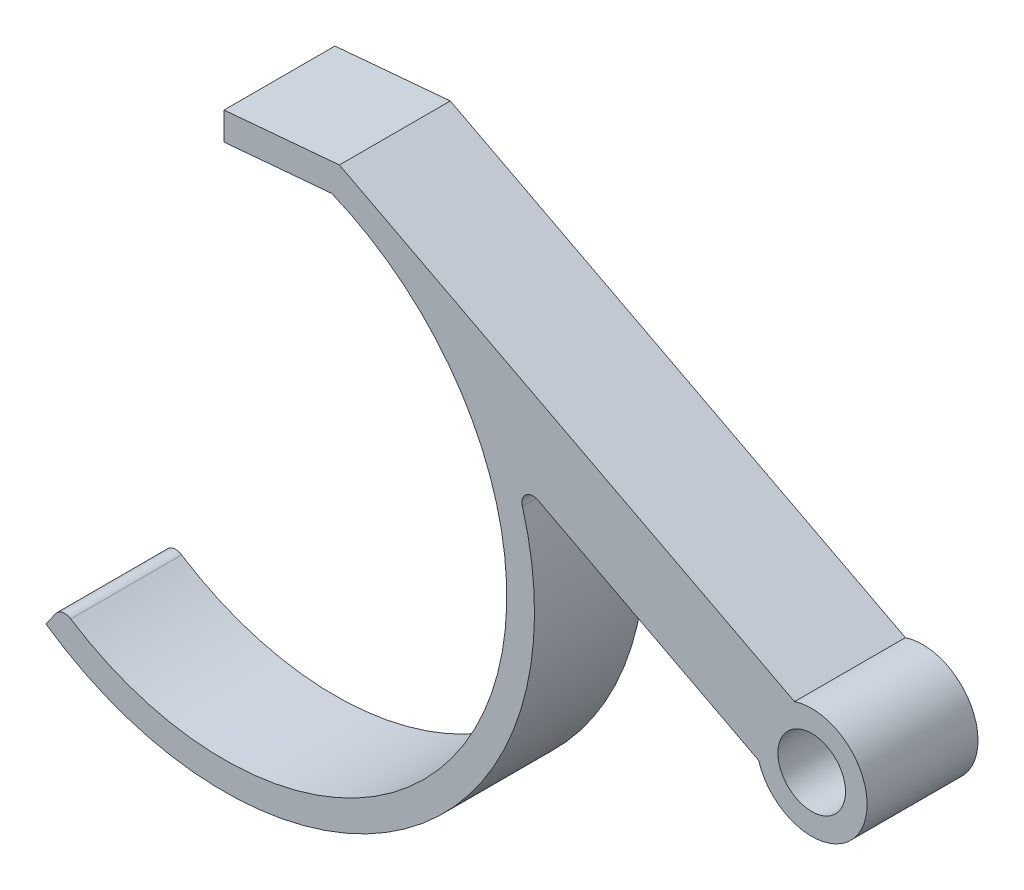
ISO-10303-21;
HEADER;
FILE_DESCRIPTION(('STEP AP214'),'2;1');
FILE_NAME('part.step','',(''),(''),'','','');
FILE_SCHEMA(('AUTOMOTIVE_DESIGN { 1 0 10303 214 1 1 1 1 }'));
ENDSEC;
DATA;
#1=APPLICATION_CONTEXT('core data for automotive mechanical design processes');
#2=APPLICATION_PROTOCOL_DEFINITION('international standard','automotive_design',2000,#1);
#3=PRODUCT_CONTEXT('',#1,'mechanical');
#4=PRODUCT('Part','Part','',(#3));
#5=PRODUCT_RELATED_PRODUCT_CATEGORY('part','',(#4));
#6=PRODUCT_DEFINITION_FORMATION('','',#4);
#7=PRODUCT_DEFINITION_CONTEXT('part definition',#1,'design');
#8=PRODUCT_DEFINITION('design','',#6,#7);
#9=PRODUCT_DEFINITION_SHAPE('','',#8);
#10=(LENGTH_UNIT() NAMED_UNIT(*) SI_UNIT(.MILLI.,.METRE.));
#11=(NAMED_UNIT(*) PLANE_ANGLE_UNIT() SI_UNIT($,.RADIAN.));
#12=(NAMED_UNIT(*) SI_UNIT($,.STERADIAN.) SOLID_ANGLE_UNIT());
#13=UNCERTAINTY_MEASURE_WITH_UNIT(LENGTH_MEASURE(1.E-05),#10,'distance_accuracy_value','');
#14=(GEOMETRIC_REPRESENTATION_CONTEXT(3) GLOBAL_UNCERTAINTY_ASSIGNED_CONTEXT((#13)) GLOBAL_UNIT_ASSIGNED_CONTEXT((#10,
#11,#12)) REPRESENTATION_CONTEXT('',''));
#15=CARTESIAN_POINT('',(0.,0.,0.));
#16=DIRECTION('',(0.,0.,1.));
#17=DIRECTION('',(1.,0.,0.));
#18=AXIS2_PLACEMENT_3D('',#15,#16,#17);
#19=CARTESIAN_POINT('',(27.8674439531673,8.02530793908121,10.));
#20=DIRECTION('',(0.,0.,-1.));
#21=DIRECTION('',(-1.,0.,0.));
#22=AXIS2_PLACEMENT_3D('',#19,#20,#21);
#23=CYLINDRICAL_SURFACE('',#22,1.);
#24=CARTESIAN_POINT('',(27.8674439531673,8.02530793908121,0.));
#25=DIRECTION('',(0.,0.,1.));
#26=DIRECTION('',(1.,0.,0.));
#27=AXIS2_PLACEMENT_3D('',#24,#25,#26);
#28=CIRCLE('',#27,1.);
#29=CARTESIAN_POINT('',(28.3296569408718,8.91207687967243,0.));
#30=VERTEX_POINT('',#29);
#31=CARTESIAN_POINT('',(26.9064976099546,7.74857318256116,0.));
#32=VERTEX_POINT('',#31);
#33=EDGE_CURVE('E147',#30,#32,#28,.T.);
#34=ORIENTED_EDGE('',*,*,#33,.F.);
#35=DIRECTION('',(0.,0.,-1.));
#36=VECTOR('',#35,1.);
#37=CARTESIAN_POINT('',(28.3296569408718,8.91207687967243,10.));
#38=LINE('',#37,#36);
#39=CARTESIAN_POINT('',(28.3296569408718,8.91207687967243,10.));
#40=VERTEX_POINT('',#39);
#41=EDGE_CURVE('E11',#40,#30,#38,.T.);
#42=ORIENTED_EDGE('',*,*,#41,.F.);
#43=CARTESIAN_POINT('',(27.8674439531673,8.02530793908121,10.));
#44=DIRECTION('',(0.,0.,1.));
#45=DIRECTION('',(1.,0.,0.));
#46=AXIS2_PLACEMENT_3D('',#43,#44,#45);
#47=CIRCLE('',#46,1.);
#48=CARTESIAN_POINT('',(26.9064976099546,7.74857318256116,10.));
#49=VERTEX_POINT('',#48);
#50=EDGE_CURVE('E177',#40,#49,#47,.T.);
#51=ORIENTED_EDGE('',*,*,#50,.T.);
#52=DIRECTION('',(0.,0.,-1.));
#53=VECTOR('',#52,1.);
#54=CARTESIAN_POINT('',(26.9064976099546,7.74857318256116,10.));
#55=LINE('',#54,#53);
#56=EDGE_CURVE('E94',#49,#32,#55,.T.);
#57=ORIENTED_EDGE('',*,*,#56,.T.);
#58=EDGE_LOOP('',(#34,#42,#51,#57));
#59=FACE_BOUND('',#58,.T.);
#60=ADVANCED_FACE('F34',(#59),#23,.F.);
#61=CARTESIAN_POINT('',(9.70521938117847,18.6197431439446,10.));
#62=DIRECTION('',(-0.462212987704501,-0.886768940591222,0.));
#63=DIRECTION('',(0.886768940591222,-0.462212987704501,0.));
#64=AXIS2_PLACEMENT_3D('',#61,#62,#63);
#65=PLANE('',#64);
#66=DIRECTION('',(-0.886768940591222,0.462212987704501,0.));
#67=VECTOR('',#66,1.);
#68=CARTESIAN_POINT('',(9.70521938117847,18.6197431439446,0.));
#69=LINE('',#68,#67);
#70=CARTESIAN_POINT('',(48.2158560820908,-1.45326080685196,0.));
#71=VERTEX_POINT('',#70);
#72=EDGE_CURVE('E150',#71,#30,#69,.T.);
#73=ORIENTED_EDGE('',*,*,#72,.F.);
#74=DIRECTION('',(0.,0.,-1.));
#75=VECTOR('',#74,1.);
#76=CARTESIAN_POINT('',(48.2158560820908,-1.45326080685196,10.));
#77=LINE('',#76,#75);
#78=CARTESIAN_POINT('',(48.2158560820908,-1.45326080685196,10.));
#79=VERTEX_POINT('',#78);
#80=EDGE_CURVE('E42',#79,#71,#77,.T.);
#81=ORIENTED_EDGE('',*,*,#80,.F.);
#82=DIRECTION('',(-0.886768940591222,0.462212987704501,0.));
#83=VECTOR('',#82,1.);
#84=CARTESIAN_POINT('',(9.70521938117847,18.6197431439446,10.));
#85=LINE('',#84,#83);
#86=EDGE_CURVE('E206',#79,#40,#85,.T.);
#87=ORIENTED_EDGE('',*,*,#86,.T.);
#88=ORIENTED_EDGE('',*,*,#41,.T.);
#89=EDGE_LOOP('',(#73,#81,#87,#88));
#90=FACE_BOUND('',#89,.T.);
#91=ADVANCED_FACE('F205',(#90),#65,.T.);
#92=CARTESIAN_POINT('',(53.,0.,10.));
#93=DIRECTION('',(0.,0.,-1.));
#94=DIRECTION('',(-1.,0.,0.));
#95=AXIS2_PLACEMENT_3D('',#92,#93,#94);
#96=CYLINDRICAL_SURFACE('',#95,5.);
#97=CARTESIAN_POINT('',(53.,0.,0.));
#98=DIRECTION('',(0.,0.,1.));
#99=DIRECTION('',(1.,0.,0.));
#100=AXIS2_PLACEMENT_3D('',#97,#98,#99);
#101=CIRCLE('',#100,5.);
#102=CARTESIAN_POINT('',(51.4513469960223,4.7541217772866,0.));
#103=VERTEX_POINT('',#102);
#104=EDGE_CURVE('E153',#71,#103,#101,.T.);
#105=ORIENTED_EDGE('',*,*,#104,.T.);
#106=DIRECTION('',(0.,0.,-1.));
#107=VECTOR('',#106,1.);
#108=CARTESIAN_POINT('',(51.4513469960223,4.7541217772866,10.));
#109=LINE('',#108,#107);
#110=CARTESIAN_POINT('',(51.4513469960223,4.7541217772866,10.));
#111=VERTEX_POINT('',#110);
#112=EDGE_CURVE('E189',#111,#103,#109,.T.);
#113=ORIENTED_EDGE('',*,*,#112,.F.);
#114=CARTESIAN_POINT('',(53.,0.,10.));
#115=DIRECTION('',(0.,0.,1.));
#116=DIRECTION('',(1.,0.,0.));
#117=AXIS2_PLACEMENT_3D('',#114,#115,#116);
#118=CIRCLE('',#117,5.);
#119=EDGE_CURVE('E196',#79,#111,#118,.T.);
#120=ORIENTED_EDGE('',*,*,#119,.F.);
#121=ORIENTED_EDGE('',*,*,#80,.T.);
#122=EDGE_LOOP('',(#105,#113,#120,#121));
#123=FACE_BOUND('',#122,.T.);
#124=ADVANCED_FACE('F194',(#123),#96,.T.);
#125=CARTESIAN_POINT('',(12.94071029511,24.8271257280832,10.));
#126=DIRECTION('',(-0.462212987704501,-0.886768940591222,0.));
#127=DIRECTION('',(0.886768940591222,-0.462212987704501,0.));
#128=AXIS2_PLACEMENT_3D('',#125,#126,#127);
#129=PLANE('',#128);
#130=DIRECTION('',(-0.886768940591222,0.462212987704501,0.));
#131=VECTOR('',#130,1.);
#132=CARTESIAN_POINT('',(12.94071029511,24.8271257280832,0.));
#133=LINE('',#132,#131);
#134=CARTESIAN_POINT('',(10.4032779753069,26.1497184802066,0.));
#135=VERTEX_POINT('',#134);
#136=EDGE_CURVE('E155',#103,#135,#133,.T.);
#137=ORIENTED_EDGE('',*,*,#136,.T.);
#138=DIRECTION('',(0.,0.,-1.));
#139=VECTOR('',#138,1.);
#140=CARTESIAN_POINT('',(10.4032779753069,26.1497184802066,10.));
#141=LINE('',#140,#139);
#142=CARTESIAN_POINT('',(10.4032779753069,26.1497184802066,10.));
#143=VERTEX_POINT('',#142);
#144=EDGE_CURVE('E187',#143,#135,#141,.T.);
#145=ORIENTED_EDGE('',*,*,#144,.F.);
#146=DIRECTION('',(-0.886768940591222,0.462212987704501,0.));
#147=VECTOR('',#146,1.);
#148=CARTESIAN_POINT('',(12.94071029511,24.8271257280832,10.));
#149=LINE('',#148,#147);
#150=EDGE_CURVE('E214',#111,#143,#149,.T.);
#151=ORIENTED_EDGE('',*,*,#150,.F.);
#152=ORIENTED_EDGE('',*,*,#112,.T.);
#153=EDGE_LOOP('',(#137,#145,#151,#152));
#154=FACE_BOUND('',#153,.T.);
#155=ADVANCED_FACE('F241',(#154),#129,.F.);
#156=CARTESIAN_POINT('',(-2.1914008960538,25.0478268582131,10.));
#157=DIRECTION('',(-0.087155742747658,0.996194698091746,0.));
#158=DIRECTION('',(-0.996194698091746,-0.087155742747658,0.));
#159=AXIS2_PLACEMENT_3D('',#156,#157,#158);
#160=PLANE('',#159);
#161=DIRECTION('',(0.996194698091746,0.087155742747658,0.));
#162=VECTOR('',#161,1.);
#163=CARTESIAN_POINT('',(-2.1914008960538,25.0478268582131,0.));
#164=LINE('',#163,#162);
#165=CARTESIAN_POINT('',(0.,25.2395495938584,0.));
#166=VERTEX_POINT('',#165);
#167=EDGE_CURVE('E158',#166,#135,#164,.T.);
#168=ORIENTED_EDGE('',*,*,#167,.F.);
#169=DIRECTION('',(0.,0.,-1.));
#170=VECTOR('',#169,1.);
#171=CARTESIAN_POINT('',(0.,25.2395495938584,10.));
#172=LINE('',#171,#170);
#173=CARTESIAN_POINT('',(0.,25.2395495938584,10.));
#174=VERTEX_POINT('',#173);
#175=EDGE_CURVE('E185',#174,#166,#172,.T.);
#176=ORIENTED_EDGE('',*,*,#175,.F.);
#177=DIRECTION('',(0.996194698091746,0.087155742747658,0.));
#178=VECTOR('',#177,1.);
#179=CARTESIAN_POINT('',(-2.1914008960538,25.0478268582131,10.));
#180=LINE('',#179,#178);
#181=EDGE_CURVE('E216',#174,#143,#180,.T.);
#182=ORIENTED_EDGE('',*,*,#181,.T.);
#183=ORIENTED_EDGE('',*,*,#144,.T.);
#184=EDGE_LOOP('',(#168,#176,#182,#183));
#185=FACE_BOUND('',#184,.T.);
#186=ADVANCED_FACE('F237',(#185),#160,.T.);
#187=CARTESIAN_POINT('',(0.,0.,10.));
#188=DIRECTION('',(-1.,0.,0.));
#189=DIRECTION('',(0.,-1.,0.));
#190=AXIS2_PLACEMENT_3D('',#187,#188,#189);
#191=PLANE('',#190);
#192=DIRECTION('',(0.,1.,0.));
#193=VECTOR('',#192,1.);
#194=CARTESIAN_POINT('',(0.,0.,0.));
#195=LINE('',#194,#193);
#196=CARTESIAN_POINT('',(0.,22.73,0.));
#197=VERTEX_POINT('',#196);
#198=EDGE_CURVE('E161',#197,#166,#195,.T.);
#199=ORIENTED_EDGE('',*,*,#198,.F.);
#200=DIRECTION('',(0.,0.,-1.));
#201=VECTOR('',#200,1.);
#202=CARTESIAN_POINT('',(0.,22.73,10.));
#203=LINE('',#202,#201);
#204=CARTESIAN_POINT('',(0.,22.73,10.));
#205=VERTEX_POINT('',#204);
#206=EDGE_CURVE('E183',#205,#197,#203,.T.);
#207=ORIENTED_EDGE('',*,*,#206,.F.);
#208=DIRECTION('',(0.,1.,0.));
#209=VECTOR('',#208,1.);
#210=CARTESIAN_POINT('',(0.,0.,10.));
#211=LINE('',#210,#209);
#212=EDGE_CURVE('E219',#205,#174,#211,.T.);
#213=ORIENTED_EDGE('',*,*,#212,.T.);
#214=ORIENTED_EDGE('',*,*,#175,.T.);
#215=EDGE_LOOP('',(#199,#207,#213,#214));
#216=FACE_BOUND('',#215,.T.);
#217=ADVANCED_FACE('F231',(#216),#191,.T.);
#218=CARTESIAN_POINT('',(-1.97351153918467,22.5573401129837,10.));
#219=DIRECTION('',(-0.0871557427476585,0.996194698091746,0.));
#220=DIRECTION('',(-0.996194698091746,-0.0871557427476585,0.));
#221=AXIS2_PLACEMENT_3D('',#218,#219,#220);
#222=PLANE('',#221);
#223=DIRECTION('',(0.996194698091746,0.0871557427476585,0.));
#224=VECTOR('',#223,1.);
#225=CARTESIAN_POINT('',(-1.97351153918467,22.5573401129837,0.));
#226=LINE('',#225,#224);
#227=CARTESIAN_POINT('',(9.70882674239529,23.5794122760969,0.));
#228=VERTEX_POINT('',#227);
#229=EDGE_CURVE('E164',#197,#228,#226,.T.);
#230=ORIENTED_EDGE('',*,*,#229,.T.);
#231=DIRECTION('',(0.,0.,-1.));
#232=VECTOR('',#231,1.);
#233=CARTESIAN_POINT('',(9.70882674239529,23.5794122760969,10.));
#234=LINE('',#233,#232);
#235=CARTESIAN_POINT('',(9.70882674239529,23.5794122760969,10.));
#236=VERTEX_POINT('',#235);
#237=EDGE_CURVE('E181',#236,#228,#234,.T.);
#238=ORIENTED_EDGE('',*,*,#237,.F.);
#239=DIRECTION('',(0.996194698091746,0.0871557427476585,0.));
#240=VECTOR('',#239,1.);
#241=CARTESIAN_POINT('',(-1.97351153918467,22.5573401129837,10.));
#242=LINE('',#241,#240);
#243=EDGE_CURVE('E222',#205,#236,#242,.T.);
#244=ORIENTED_EDGE('',*,*,#243,.F.);
#245=ORIENTED_EDGE('',*,*,#206,.T.);
#246=EDGE_LOOP('',(#230,#238,#244,#245));
#247=FACE_BOUND('',#246,.T.);
#248=ADVANCED_FACE('F242',(#247),#222,.F.);
#249=CARTESIAN_POINT('',(0.,0.,10.));
#250=DIRECTION('',(0.,0.,-1.));
#251=DIRECTION('',(-1.,0.,0.));
#252=AXIS2_PLACEMENT_3D('',#249,#250,#251);
#253=CYLINDRICAL_SURFACE('',#252,25.5);
#254=CARTESIAN_POINT('',(0.,0.,0.));
#255=DIRECTION('',(0.,0.,1.));
#256=DIRECTION('',(1.,0.,0.));
#257=AXIS2_PLACEMENT_3D('',#254,#255,#256);
#258=CIRCLE('',#257,25.5);
#259=CARTESIAN_POINT('',(-13.8275409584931,-21.42543140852,0.));
#260=VERTEX_POINT('',#259);
#261=EDGE_CURVE('E167',#260,#228,#258,.T.);
#262=ORIENTED_EDGE('',*,*,#261,.F.);
#263=DIRECTION('',(0.,0.,-1.));
#264=VECTOR('',#263,1.);
#265=CARTESIAN_POINT('',(-13.8275409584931,-21.42543140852,10.));
#266=LINE('',#265,#264);
#267=CARTESIAN_POINT('',(-13.8275409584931,-21.42543140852,10.));
#268=VERTEX_POINT('',#267);
#269=EDGE_CURVE('E136',#268,#260,#266,.T.);
#270=ORIENTED_EDGE('',*,*,#269,.F.);
#271=CARTESIAN_POINT('',(0.,0.,10.));
#272=DIRECTION('',(0.,0.,1.));
#273=DIRECTION('',(1.,0.,0.));
#274=AXIS2_PLACEMENT_3D('',#271,#272,#273);
#275=CIRCLE('',#274,25.5);
#276=EDGE_CURVE('E129',#268,#236,#275,.T.);
#277=ORIENTED_EDGE('',*,*,#276,.T.);
#278=ORIENTED_EDGE('',*,*,#237,.T.);
#279=EDGE_LOOP('',(#262,#270,#277,#278));
#280=FACE_BOUND('',#279,.T.);
#281=ADVANCED_FACE('F225',(#280),#253,.F.);
#282=CARTESIAN_POINT('',(-14.3697974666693,-22.2656444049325,10.));
#283=DIRECTION('',(0.,0.,-1.));
#284=DIRECTION('',(-1.,0.,0.));
#285=AXIS2_PLACEMENT_3D('',#282,#283,#284);
#286=CYLINDRICAL_SURFACE('',#285,1.);
#287=CARTESIAN_POINT('',(-14.3697974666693,-22.2656444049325,0.));
#288=DIRECTION('',(0.,0.,1.));
#289=DIRECTION('',(1.,0.,0.));
#290=AXIS2_PLACEMENT_3D('',#287,#288,#289);
#291=CIRCLE('',#290,1.);
#292=CARTESIAN_POINT('',(-15.1889495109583,-21.6920679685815,0.));
#293=VERTEX_POINT('',#292);
#294=EDGE_CURVE('E135',#260,#293,#291,.T.);
#295=ORIENTED_EDGE('',*,*,#294,.T.);
#296=DIRECTION('',(0.,0.,-1.));
#297=VECTOR('',#296,1.);
#298=CARTESIAN_POINT('',(-15.1889495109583,-21.6920679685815,10.));
#299=LINE('',#298,#297);
#300=CARTESIAN_POINT('',(-15.1889495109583,-21.6920679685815,10.));
#301=VERTEX_POINT('',#300);
#302=EDGE_CURVE('E132',#301,#293,#299,.T.);
#303=ORIENTED_EDGE('',*,*,#302,.F.);
#304=CARTESIAN_POINT('',(-14.3697974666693,-22.2656444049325,10.));
#305=DIRECTION('',(0.,0.,1.));
#306=DIRECTION('',(1.,0.,0.));
#307=AXIS2_PLACEMENT_3D('',#304,#305,#306);
#308=CIRCLE('',#307,1.);
#309=EDGE_CURVE('E122',#268,#301,#308,.T.);
#310=ORIENTED_EDGE('',*,*,#309,.F.);
#311=ORIENTED_EDGE('',*,*,#269,.T.);
#312=EDGE_LOOP('',(#295,#303,#310,#311));
#313=FACE_BOUND('',#312,.T.);
#314=ADVANCED_FACE('F133',(#313),#286,.T.);
#315=CARTESIAN_POINT('',(0.,0.,10.));
#316=DIRECTION('',(0.819152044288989,-0.57357643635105,0.));
#317=DIRECTION('',(0.57357643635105,0.819152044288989,0.));
#318=AXIS2_PLACEMENT_3D('',#315,#316,#317);
#319=PLANE('',#318);
#320=DIRECTION('',(-0.57357643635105,-0.819152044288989,0.));
#321=VECTOR('',#320,1.);
#322=CARTESIAN_POINT('',(0.,0.,0.));
#323=LINE('',#322,#321);
#324=CARTESIAN_POINT('',(-16.0601402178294,-22.9362572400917,0.));
#325=VERTEX_POINT('',#324);
#326=EDGE_CURVE('E87',#293,#325,#323,.T.);
#327=ORIENTED_EDGE('',*,*,#326,.T.);
#328=DIRECTION('',(0.,0.,-1.));
#329=VECTOR('',#328,1.);
#330=CARTESIAN_POINT('',(-16.0601402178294,-22.9362572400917,10.));
#331=LINE('',#330,#329);
#332=CARTESIAN_POINT('',(-16.0601402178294,-22.9362572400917,10.));
#333=VERTEX_POINT('',#332);
#334=EDGE_CURVE('E137',#333,#325,#331,.T.);
#335=ORIENTED_EDGE('',*,*,#334,.F.);
#336=DIRECTION('',(-0.57357643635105,-0.819152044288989,0.));
#337=VECTOR('',#336,1.);
#338=CARTESIAN_POINT('',(0.,0.,10.));
#339=LINE('',#338,#337);
#340=EDGE_CURVE('E127',#301,#333,#339,.T.);
#341=ORIENTED_EDGE('',*,*,#340,.F.);
#342=ORIENTED_EDGE('',*,*,#302,.T.);
#343=EDGE_LOOP('',(#327,#335,#341,#342));
#344=FACE_BOUND('',#343,.T.);
#345=ADVANCED_FACE('F139',(#344),#319,.F.);
#346=CARTESIAN_POINT('',(0.,0.,10.));
#347=DIRECTION('',(0.,0.,-1.));
#348=DIRECTION('',(-1.,0.,0.));
#349=AXIS2_PLACEMENT_3D('',#346,#347,#348);
#350=CYLINDRICAL_SURFACE('',#349,28.);
#351=CARTESIAN_POINT('',(0.,0.,0.));
#352=DIRECTION('',(0.,0.,1.));
#353=DIRECTION('',(1.,0.,0.));
#354=AXIS2_PLACEMENT_3D('',#351,#352,#353);
#355=CIRCLE('',#354,28.);
#356=EDGE_CURVE('E172',#325,#32,#355,.T.);
#357=ORIENTED_EDGE('',*,*,#356,.T.);
#358=ORIENTED_EDGE('',*,*,#56,.F.);
#359=CARTESIAN_POINT('',(0.,0.,10.));
#360=DIRECTION('',(0.,0.,1.));
#361=DIRECTION('',(1.,0.,0.));
#362=AXIS2_PLACEMENT_3D('',#359,#360,#361);
#363=CIRCLE('',#362,28.);
#364=EDGE_CURVE('E50',#333,#49,#363,.T.);
#365=ORIENTED_EDGE('',*,*,#364,.F.);
#366=ORIENTED_EDGE('',*,*,#334,.T.);
#367=EDGE_LOOP('',(#357,#358,#365,#366));
#368=FACE_BOUND('',#367,.T.);
#369=ADVANCED_FACE('F209',(#368),#350,.T.);
#370=CARTESIAN_POINT('',(53.,0.,10.));
#371=DIRECTION('',(0.,0.,-1.));
#372=DIRECTION('',(-1.,0.,0.));
#373=AXIS2_PLACEMENT_3D('',#370,#371,#372);
#374=CYLINDRICAL_SURFACE('',#373,3.05);
#375=CARTESIAN_POINT('',(53.,0.,10.));
#376=DIRECTION('',(0.,0.,1.));
#377=DIRECTION('',(1.,0.,0.));
#378=AXIS2_PLACEMENT_3D('',#375,#376,#377);
#379=CIRCLE('',#378,3.05);
#380=CARTESIAN_POINT('',(56.05,0.,10.));
#381=VERTEX_POINT('',#380);
#382=EDGE_CURVE('E141',#381,#381,#379,.T.);
#383=ORIENTED_EDGE('',*,*,#382,.T.);
#384=EDGE_LOOP('',(#383));
#385=FACE_BOUND('',#384,.T.);
#386=CARTESIAN_POINT('',(53.,0.,0.));
#387=DIRECTION('',(0.,0.,1.));
#388=DIRECTION('',(1.,0.,0.));
#389=AXIS2_PLACEMENT_3D('',#386,#387,#388);
#390=CIRCLE('',#389,3.05);
#391=CARTESIAN_POINT('',(56.05,0.,0.));
#392=VERTEX_POINT('',#391);
#393=EDGE_CURVE('E174',#392,#392,#390,.T.);
#394=ORIENTED_EDGE('',*,*,#393,.F.);
#395=EDGE_LOOP('',(#394));
#396=FACE_BOUND('',#395,.T.);
#397=ADVANCED_FACE('F306',(#385,#396),#374,.F.);
#398=CARTESIAN_POINT('',(0.,0.,10.));
#399=DIRECTION('',(0.,0.,1.));
#400=DIRECTION('',(1.,0.,0.));
#401=AXIS2_PLACEMENT_3D('',#398,#399,#400);
#402=PLANE('',#401);
#403=ORIENTED_EDGE('',*,*,#50,.F.);
#404=ORIENTED_EDGE('',*,*,#86,.F.);
#405=ORIENTED_EDGE('',*,*,#119,.T.);
#406=ORIENTED_EDGE('',*,*,#150,.T.);
#407=ORIENTED_EDGE('',*,*,#181,.F.);
#408=ORIENTED_EDGE('',*,*,#212,.F.);
#409=ORIENTED_EDGE('',*,*,#243,.T.);
#410=ORIENTED_EDGE('',*,*,#276,.F.);
#411=ORIENTED_EDGE('',*,*,#309,.T.);
#412=ORIENTED_EDGE('',*,*,#340,.T.);
#413=ORIENTED_EDGE('',*,*,#364,.T.);
#414=EDGE_LOOP('',(#403,#404,#405,#406,#407,#408,#409,#410,#411,#412,#413));
#415=FACE_BOUND('',#414,.T.);
#416=ORIENTED_EDGE('',*,*,#382,.F.);
#417=EDGE_LOOP('',(#416));
#418=FACE_BOUND('',#417,.T.);
#419=ADVANCED_FACE('F124',(#415,#418),#402,.T.);
#420=CARTESIAN_POINT('',(0.,0.,0.));
#421=DIRECTION('',(0.,0.,1.));
#422=DIRECTION('',(1.,0.,0.));
#423=AXIS2_PLACEMENT_3D('',#420,#421,#422);
#424=PLANE('',#423);
#425=ORIENTED_EDGE('',*,*,#33,.T.);
#426=ORIENTED_EDGE('',*,*,#356,.F.);
#427=ORIENTED_EDGE('',*,*,#326,.F.);
#428=ORIENTED_EDGE('',*,*,#294,.F.);
#429=ORIENTED_EDGE('',*,*,#261,.T.);
#430=ORIENTED_EDGE('',*,*,#229,.F.);
#431=ORIENTED_EDGE('',*,*,#198,.T.);
#432=ORIENTED_EDGE('',*,*,#167,.T.);
#433=ORIENTED_EDGE('',*,*,#136,.F.);
#434=ORIENTED_EDGE('',*,*,#104,.F.);
#435=ORIENTED_EDGE('',*,*,#72,.T.);
#436=EDGE_LOOP('',(#425,#426,#427,#428,#429,#430,#431,#432,#433,#434,#435));
#437=FACE_BOUND('',#436,.T.);
#438=ORIENTED_EDGE('',*,*,#393,.T.);
#439=EDGE_LOOP('',(#438));
#440=FACE_BOUND('',#439,.T.);
#441=ADVANCED_FACE('F203',(#437,#440),#424,.F.);
#442=CLOSED_SHELL('',(#60,#91,#124,#155,#186,#217,#248,#281,#314,#345,#369,#397,#419,#441));
#443=MANIFOLD_SOLID_BREP('B2',#442);
#444=ADVANCED_BREP_SHAPE_REPRESENTATION('',(#18,#443),#14);
#445=SHAPE_DEFINITION_REPRESENTATION(#9,#444);
ENDSEC;
END-ISO-10303-21;
